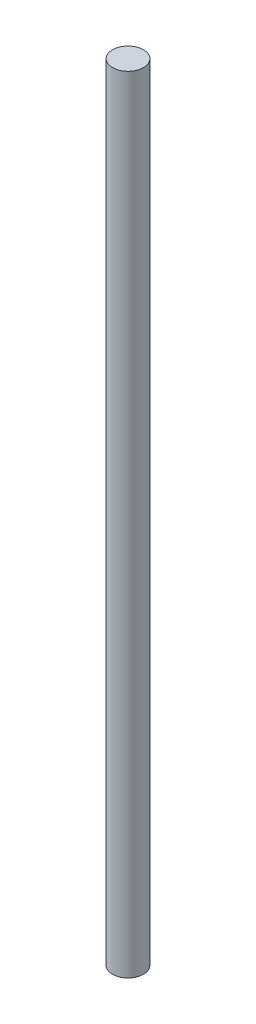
from build123d import *

# Parameters (mm, degrees)
ESQUISSE1_R      = 3
EXTRUSION1_DEPTH = 152


with BuildPart() as part:
    # Esquisse1 → Extrusion1 (new body)
    with BuildSketch(Plane(origin=(0, 0, 0), x_dir=(1, 0, 0), z_dir=(0, 1, 0))):
        with Locations(Location((0, 0, 0), (0, 0, 270))):
            Circle(ESQUISSE1_R)
    extrude(amount=EXTRUSION1_DEPTH)


solid = part.part
